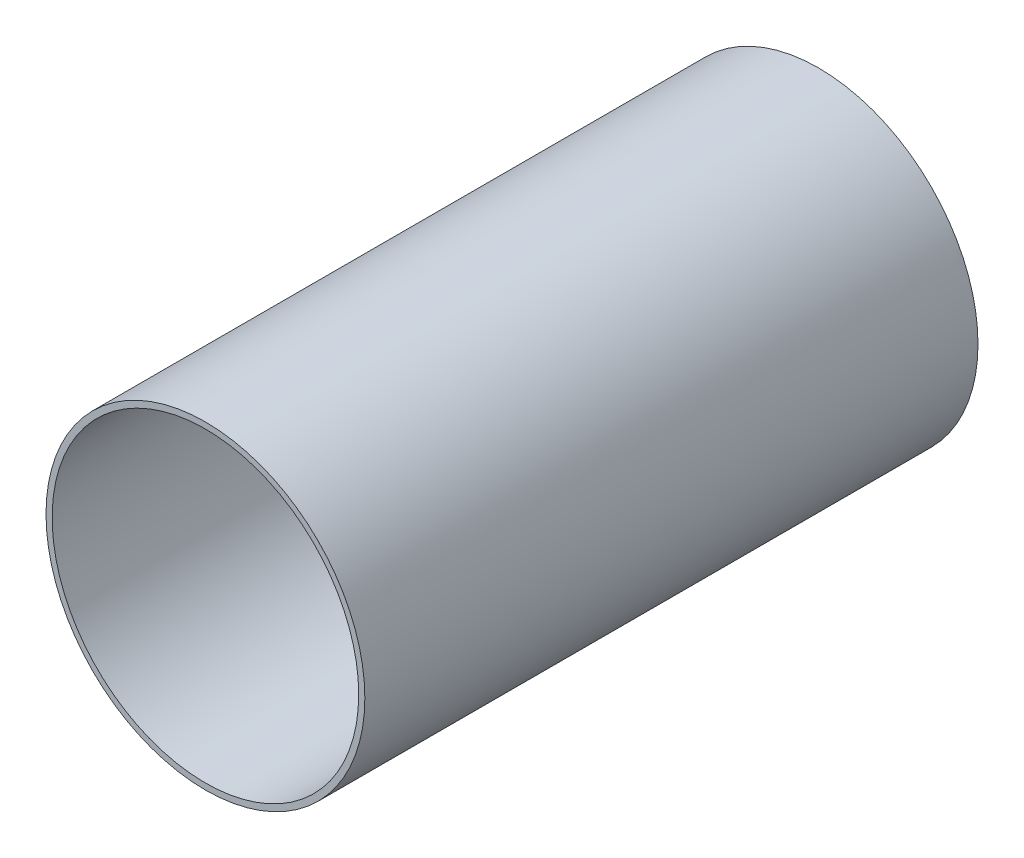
from build123d import *

# Parameters (mm, degrees)
SZKIC1_R                          = 52
SZKIC1_R_2                        = 50
WYCI_GNI_CIE_CIENKA_CIANKA1_DEPTH = 100
WYTNIJ_WYCI_GNI_CIE1_DEPTH        = 125.128965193


with BuildPart() as part:
    # Szkic1 → Wyci_gni_cie-cienka _cianka1 (new, symmetric)
    with BuildSketch(Plane.XY):
        Circle(SZKIC1_R)
        Circle(SZKIC1_R_2, mode=Mode.SUBTRACT)
    extrude(amount=WYCI_GNI_CIE_CIENKA_CIANKA1_DEPTH, both=True)

    # Szkic2 → Wytnij-wyci_gni_cie1 (cut, through all)
    with BuildSketch(Plane(origin=(0, 0, 0), x_dir=(0, 0, -1), z_dir=(1, 0, 0))):
        with BuildLine():
            Line((-38.301270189, 33.660254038), (48.301270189, -16.339745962))
            ThreePointArc((48.301270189, -16.339745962), (51.961524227, -30), (38.301270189, -33.660254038))
            Line((38.301270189, -33.660254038), (-48.301270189, 16.339745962))
            ThreePointArc((-48.301270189, 16.339745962), (-51.961524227, 30), (-38.301270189, 33.660254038))
        make_face()
    extrude(amount=-WYTNIJ_WYCI_GNI_CIE1_DEPTH, mode=Mode.SUBTRACT)


solid = part.part
